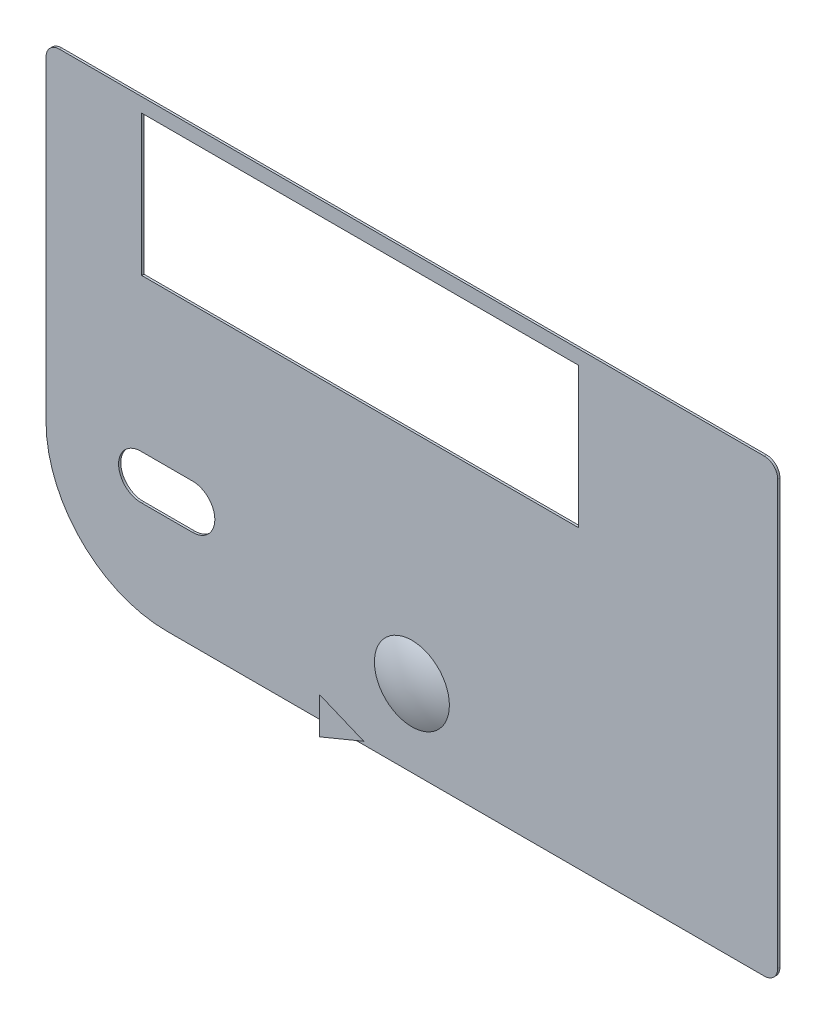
ISO-10303-21;
HEADER;
FILE_DESCRIPTION(('STEP AP214'),'2;1');
FILE_NAME('part.step','',(''),(''),'','','');
FILE_SCHEMA(('AUTOMOTIVE_DESIGN { 1 0 10303 214 1 1 1 1 }'));
ENDSEC;
DATA;
#1=APPLICATION_CONTEXT('core data for automotive mechanical design processes');
#2=APPLICATION_PROTOCOL_DEFINITION('international standard','automotive_design',2000,#1);
#3=PRODUCT_CONTEXT('',#1,'mechanical');
#4=PRODUCT('Part','Part','',(#3));
#5=PRODUCT_RELATED_PRODUCT_CATEGORY('part','',(#4));
#6=PRODUCT_DEFINITION_FORMATION('','',#4);
#7=PRODUCT_DEFINITION_CONTEXT('part definition',#1,'design');
#8=PRODUCT_DEFINITION('design','',#6,#7);
#9=PRODUCT_DEFINITION_SHAPE('','',#8);
#10=(LENGTH_UNIT() NAMED_UNIT(*) SI_UNIT(.MILLI.,.METRE.));
#11=(NAMED_UNIT(*) PLANE_ANGLE_UNIT() SI_UNIT($,.RADIAN.));
#12=(NAMED_UNIT(*) SI_UNIT($,.STERADIAN.) SOLID_ANGLE_UNIT());
#13=UNCERTAINTY_MEASURE_WITH_UNIT(LENGTH_MEASURE(1.E-05),#10,'distance_accuracy_value','');
#14=(GEOMETRIC_REPRESENTATION_CONTEXT(3) GLOBAL_UNCERTAINTY_ASSIGNED_CONTEXT((#13)) GLOBAL_UNIT_ASSIGNED_CONTEXT((#10,
#11,#12)) REPRESENTATION_CONTEXT('',''));
#15=CARTESIAN_POINT('',(0.,0.,0.));
#16=DIRECTION('',(0.,0.,1.));
#17=DIRECTION('',(1.,0.,0.));
#18=AXIS2_PLACEMENT_3D('',#15,#16,#17);
#19=CARTESIAN_POINT('',(-2.5,-22.4852813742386,10.));
#20=DIRECTION('',(0.,0.,-1.));
#21=DIRECTION('',(-1.,0.,0.));
#22=AXIS2_PLACEMENT_3D('',#19,#20,#21);
#23=PLANE('',#22);
#24=DIRECTION('',(0.923879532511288,0.382683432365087,0.));
#25=VECTOR('',#24,1.);
#26=CARTESIAN_POINT('',(-2.5,-22.4852813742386,10.));
#27=LINE('',#26,#25);
#28=CARTESIAN_POINT('',(-2.5,-22.4852813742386,10.));
#29=VERTEX_POINT('',#28);
#30=CARTESIAN_POINT('',(3.5,-20.,10.));
#31=VERTEX_POINT('',#30);
#32=EDGE_CURVE('E55',#29,#31,#27,.T.);
#33=ORIENTED_EDGE('',*,*,#32,.T.);
#34=DIRECTION('',(-0.923879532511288,0.382683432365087,0.));
#35=VECTOR('',#34,1.);
#36=CARTESIAN_POINT('',(3.5,-20.,10.));
#37=LINE('',#36,#35);
#38=CARTESIAN_POINT('',(-2.5,-17.5147186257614,10.));
#39=VERTEX_POINT('',#38);
#40=EDGE_CURVE('E51',#31,#39,#37,.T.);
#41=ORIENTED_EDGE('',*,*,#40,.T.);
#42=DIRECTION('',(0.,-1.,0.));
#43=VECTOR('',#42,1.);
#44=CARTESIAN_POINT('',(-2.5,-17.5147186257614,10.));
#45=LINE('',#44,#43);
#46=EDGE_CURVE('E12',#39,#29,#45,.T.);
#47=ORIENTED_EDGE('',*,*,#46,.T.);
#48=EDGE_LOOP('',(#33,#41,#47));
#49=FACE_BOUND('',#48,.T.);
#50=ADVANCED_FACE('F46',(#49),#23,.F.);
#51=OPEN_SHELL('',(#50));
#52=SHELL_BASED_SURFACE_MODEL('B2',(#51));
#53=CARTESIAN_POINT('',(0.,-20.,-11.2087121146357));
#54=DIRECTION('',(0.,0.,-1.));
#55=DIRECTION('',(0.,1.,0.));
#56=AXIS2_PLACEMENT_3D('',#53,#54,#55);
#57=SPHERICAL_SURFACE('',#56,12.);
#58=CARTESIAN_POINT('',(0.,-20.,-0.299999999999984));
#59=DIRECTION('',(0.,0.,-1.));
#60=DIRECTION('',(0.,1.,0.));
#61=AXIS2_PLACEMENT_3D('',#58,#59,#60);
#62=CIRCLE('',#61,5.);
#63=CARTESIAN_POINT('',(0.,-15.,-0.3));
#64=VERTEX_POINT('',#63);
#65=EDGE_CURVE('E45',#64,#64,#62,.T.);
#66=ORIENTED_EDGE('',*,*,#65,.F.);
#67=EDGE_LOOP('',(#66));
#68=FACE_BOUND('',#67,.T.);
#69=ADVANCED_FACE('F90',(#68),#57,.T.);
#70=CARTESIAN_POINT('',(0.,-15.,-0.300000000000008));
#71=DIRECTION('',(0.,0.,-1.));
#72=DIRECTION('',(0.,1.,0.));
#73=AXIS2_PLACEMENT_3D('',#70,#71,#72);
#74=PLANE('',#73);
#75=ORIENTED_EDGE('',*,*,#65,.T.);
#76=EDGE_LOOP('',(#75));
#77=FACE_BOUND('',#76,.T.);
#78=ADVANCED_FACE('F97',(#77),#74,.T.);
#79=CLOSED_SHELL('',(#69,#78));
#80=MANIFOLD_SOLID_BREP('B6_NOT_SHOWN',#79);
#81=CARTESIAN_POINT('',(-47.625,28.625,-0.3));
#82=DIRECTION('',(0.,0.,1.));
#83=DIRECTION('',(1.,0.,0.));
#84=AXIS2_PLACEMENT_3D('',#81,#82,#83);
#85=PLANE('',#84);
#86=CARTESIAN_POINT('',(-47.625,28.625,-0.3));
#87=DIRECTION('',(0.,0.,1.));
#88=DIRECTION('',(1.,0.,0.));
#89=AXIS2_PLACEMENT_3D('',#86,#87,#88);
#90=CIRCLE('',#89,1.8);
#91=CARTESIAN_POINT('',(-47.625,30.425,-0.3));
#92=VERTEX_POINT('',#91);
#93=CARTESIAN_POINT('',(-49.425,28.625,-0.3));
#94=VERTEX_POINT('',#93);
#95=EDGE_CURVE('E289',#92,#94,#90,.T.);
#96=ORIENTED_EDGE('',*,*,#95,.F.);
#97=DIRECTION('',(-1.,0.,0.));
#98=VECTOR('',#97,1.);
#99=CARTESIAN_POINT('',(-47.625,30.425,-0.3));
#100=LINE('',#99,#98);
#101=CARTESIAN_POINT('',(47.625,30.425,-0.3));
#102=VERTEX_POINT('',#101);
#103=EDGE_CURVE('E311',#102,#92,#100,.T.);
#104=ORIENTED_EDGE('',*,*,#103,.F.);
#105=CARTESIAN_POINT('',(47.625,28.625,-0.3));
#106=DIRECTION('',(0.,0.,1.));
#107=DIRECTION('',(-1.,0.,0.));
#108=AXIS2_PLACEMENT_3D('',#105,#106,#107);
#109=CIRCLE('',#108,1.8);
#110=CARTESIAN_POINT('',(49.425,28.625,-0.3));
#111=VERTEX_POINT('',#110);
#112=EDGE_CURVE('E308',#111,#102,#109,.T.);
#113=ORIENTED_EDGE('',*,*,#112,.F.);
#114=DIRECTION('',(0.,1.,0.));
#115=VECTOR('',#114,1.);
#116=CARTESIAN_POINT('',(49.425,28.625,-0.3));
#117=LINE('',#116,#115);
#118=CARTESIAN_POINT('',(49.425,-28.625,-0.3));
#119=VERTEX_POINT('',#118);
#120=EDGE_CURVE('E305',#119,#111,#117,.T.);
#121=ORIENTED_EDGE('',*,*,#120,.F.);
#122=CARTESIAN_POINT('',(47.625,-28.625,-0.3));
#123=DIRECTION('',(0.,0.,1.));
#124=DIRECTION('',(1.,0.,0.));
#125=AXIS2_PLACEMENT_3D('',#122,#123,#124);
#126=CIRCLE('',#125,1.8);
#127=CARTESIAN_POINT('',(47.625,-30.425,-0.3));
#128=VERTEX_POINT('',#127);
#129=EDGE_CURVE('E302',#128,#119,#126,.T.);
#130=ORIENTED_EDGE('',*,*,#129,.F.);
#131=DIRECTION('',(1.,0.,0.));
#132=VECTOR('',#131,1.);
#133=CARTESIAN_POINT('',(-33.125,-30.425,-0.3));
#134=LINE('',#133,#132);
#135=CARTESIAN_POINT('',(-33.125,-30.425,-0.3));
#136=VERTEX_POINT('',#135);
#137=EDGE_CURVE('E299',#136,#128,#134,.T.);
#138=ORIENTED_EDGE('',*,*,#137,.F.);
#139=CARTESIAN_POINT('',(-33.125,-14.125,-0.3));
#140=DIRECTION('',(0.,0.,1.));
#141=DIRECTION('',(1.,0.,0.));
#142=AXIS2_PLACEMENT_3D('',#139,#140,#141);
#143=CIRCLE('',#142,16.3);
#144=CARTESIAN_POINT('',(-49.425,-14.125,-0.3));
#145=VERTEX_POINT('',#144);
#146=EDGE_CURVE('E296',#145,#136,#143,.T.);
#147=ORIENTED_EDGE('',*,*,#146,.F.);
#148=DIRECTION('',(0.,-1.,0.));
#149=VECTOR('',#148,1.);
#150=CARTESIAN_POINT('',(-49.425,28.625,-0.3));
#151=LINE('',#150,#149);
#152=EDGE_CURVE('E292',#94,#145,#151,.T.);
#153=ORIENTED_EDGE('',*,*,#152,.F.);
#154=EDGE_LOOP('',(#96,#104,#113,#121,#130,#138,#147,#153));
#155=FACE_BOUND('',#154,.T.);
#156=DIRECTION('',(-1.,0.,0.));
#157=VECTOR('',#156,1.);
#158=CARTESIAN_POINT('',(-47.625,-11.1247769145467,-0.3));
#159=LINE('',#158,#157);
#160=CARTESIAN_POINT('',(-29.6250000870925,-11.1247769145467,-0.3));
#161=VERTEX_POINT('',#160);
#162=CARTESIAN_POINT('',(-36.6249999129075,-11.1247769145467,-0.3));
#163=VERTEX_POINT('',#162);
#164=EDGE_CURVE('E282',#161,#163,#159,.T.);
#165=ORIENTED_EDGE('',*,*,#164,.T.);
#166=CARTESIAN_POINT('',(-36.6249999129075,-14.1263385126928,-0.3));
#167=DIRECTION('',(0.,0.,1.));
#168=DIRECTION('',(1.,0.,0.));
#169=AXIS2_PLACEMENT_3D('',#166,#167,#168);
#170=CIRCLE('',#169,3.00156159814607);
#171=CARTESIAN_POINT('',(-36.4881087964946,-17.1247769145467,-0.3));
#172=VERTEX_POINT('',#171);
#173=EDGE_CURVE('E285',#163,#172,#170,.T.);
#174=ORIENTED_EDGE('',*,*,#173,.T.);
#175=DIRECTION('',(1.,0.,0.));
#176=VECTOR('',#175,1.);
#177=CARTESIAN_POINT('',(-47.625,-17.1247769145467,-0.3));
#178=LINE('',#177,#176);
#179=CARTESIAN_POINT('',(-29.6250000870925,-17.1247769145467,-0.3));
#180=VERTEX_POINT('',#179);
#181=EDGE_CURVE('E270',#172,#180,#178,.T.);
#182=ORIENTED_EDGE('',*,*,#181,.T.);
#183=CARTESIAN_POINT('',(-29.6250000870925,-14.1247769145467,-0.3));
#184=DIRECTION('',(0.,0.,1.));
#185=DIRECTION('',(1.,0.,0.));
#186=AXIS2_PLACEMENT_3D('',#183,#184,#185);
#187=CIRCLE('',#186,3.);
#188=EDGE_CURVE('E279',#180,#161,#187,.T.);
#189=ORIENTED_EDGE('',*,*,#188,.T.);
#190=EDGE_LOOP('',(#165,#174,#182,#189));
#191=FACE_BOUND('',#190,.T.);
#192=DIRECTION('',(0.,1.,0.));
#193=VECTOR('',#192,1.);
#194=CARTESIAN_POINT('',(-36.5,28.5,-0.3));
#195=LINE('',#194,#193);
#196=CARTESIAN_POINT('',(-36.5,9.50000000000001,-0.3));
#197=VERTEX_POINT('',#196);
#198=CARTESIAN_POINT('',(-36.5,28.5,-0.3));
#199=VERTEX_POINT('',#198);
#200=EDGE_CURVE('E241',#197,#199,#195,.T.);
#201=ORIENTED_EDGE('',*,*,#200,.F.);
#202=DIRECTION('',(-1.,0.,0.));
#203=VECTOR('',#202,1.);
#204=CARTESIAN_POINT('',(-36.5,9.5,-0.3));
#205=LINE('',#204,#203);
#206=CARTESIAN_POINT('',(22.5,9.5,-0.3));
#207=VERTEX_POINT('',#206);
#208=EDGE_CURVE('E131',#207,#197,#205,.T.);
#209=ORIENTED_EDGE('',*,*,#208,.F.);
#210=DIRECTION('',(0.,-1.,0.));
#211=VECTOR('',#210,1.);
#212=CARTESIAN_POINT('',(22.5,9.5,-0.3));
#213=LINE('',#212,#211);
#214=CARTESIAN_POINT('',(22.5,28.5,-0.3));
#215=VERTEX_POINT('',#214);
#216=EDGE_CURVE('E247',#215,#207,#213,.T.);
#217=ORIENTED_EDGE('',*,*,#216,.F.);
#218=DIRECTION('',(1.,0.,0.));
#219=VECTOR('',#218,1.);
#220=CARTESIAN_POINT('',(22.5,28.5,-0.3));
#221=LINE('',#220,#219);
#222=EDGE_CURVE('E232',#199,#215,#221,.T.);
#223=ORIENTED_EDGE('',*,*,#222,.F.);
#224=EDGE_LOOP('',(#201,#209,#217,#223));
#225=FACE_BOUND('',#224,.T.);
#226=CARTESIAN_POINT('',(0.,-20.,-0.299999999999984));
#227=DIRECTION('',(0.,0.,-1.));
#228=DIRECTION('',(0.,1.,0.));
#229=AXIS2_PLACEMENT_3D('',#226,#227,#228);
#230=CIRCLE('',#229,5.);
#231=CARTESIAN_POINT('',(0.,-15.,-0.3));
#232=VERTEX_POINT('',#231);
#233=EDGE_CURVE('E454',#232,#232,#230,.T.);
#234=ORIENTED_EDGE('',*,*,#233,.F.);
#235=EDGE_LOOP('',(#234));
#236=FACE_BOUND('',#235,.T.);
#237=ADVANCED_FACE('F116',(#155,#191,#225,#236),#85,.F.);
#238=CARTESIAN_POINT('',(-47.625,28.625,-0.3));
#239=DIRECTION('',(0.,0.,1.));
#240=DIRECTION('',(1.,0.,0.));
#241=AXIS2_PLACEMENT_3D('',#238,#239,#240);
#242=CYLINDRICAL_SURFACE('',#241,1.8);
#243=CARTESIAN_POINT('',(-47.625,28.625,0.));
#244=DIRECTION('',(0.,0.,1.));
#245=DIRECTION('',(1.,0.,0.));
#246=AXIS2_PLACEMENT_3D('',#243,#244,#245);
#247=CIRCLE('',#246,1.8);
#248=CARTESIAN_POINT('',(-47.625,30.425,0.));
#249=VERTEX_POINT('',#248);
#250=CARTESIAN_POINT('',(-49.425,28.625,0.));
#251=VERTEX_POINT('',#250);
#252=EDGE_CURVE('E288',#249,#251,#247,.T.);
#253=ORIENTED_EDGE('',*,*,#252,.F.);
#254=DIRECTION('',(0.,0.,1.));
#255=VECTOR('',#254,1.);
#256=CARTESIAN_POINT('',(-47.625,30.425,-0.3));
#257=LINE('',#256,#255);
#258=EDGE_CURVE('E337',#92,#249,#257,.T.);
#259=ORIENTED_EDGE('',*,*,#258,.F.);
#260=ORIENTED_EDGE('',*,*,#95,.T.);
#261=DIRECTION('',(0.,0.,1.));
#262=VECTOR('',#261,1.);
#263=CARTESIAN_POINT('',(-49.425,28.625,-0.3));
#264=LINE('',#263,#262);
#265=EDGE_CURVE('E314',#94,#251,#264,.T.);
#266=ORIENTED_EDGE('',*,*,#265,.T.);
#267=EDGE_LOOP('',(#253,#259,#260,#266));
#268=FACE_BOUND('',#267,.T.);
#269=ADVANCED_FACE('F118',(#268),#242,.T.);
#270=CARTESIAN_POINT('',(-47.625,30.425,-0.3));
#271=DIRECTION('',(0.,1.,0.));
#272=DIRECTION('',(0.,0.,1.));
#273=AXIS2_PLACEMENT_3D('',#270,#271,#272);
#274=PLANE('',#273);
#275=DIRECTION('',(-1.,0.,0.));
#276=VECTOR('',#275,1.);
#277=CARTESIAN_POINT('',(-47.625,30.425,0.));
#278=LINE('',#277,#276);
#279=CARTESIAN_POINT('',(47.625,30.425,0.));
#280=VERTEX_POINT('',#279);
#281=EDGE_CURVE('E293',#280,#249,#278,.T.);
#282=ORIENTED_EDGE('',*,*,#281,.F.);
#283=DIRECTION('',(0.,0.,1.));
#284=VECTOR('',#283,1.);
#285=CARTESIAN_POINT('',(47.625,30.425,-0.3));
#286=LINE('',#285,#284);
#287=EDGE_CURVE('E340',#102,#280,#286,.T.);
#288=ORIENTED_EDGE('',*,*,#287,.F.);
#289=ORIENTED_EDGE('',*,*,#103,.T.);
#290=ORIENTED_EDGE('',*,*,#258,.T.);
#291=EDGE_LOOP('',(#282,#288,#289,#290));
#292=FACE_BOUND('',#291,.T.);
#293=ADVANCED_FACE('F400',(#292),#274,.T.);
#294=CARTESIAN_POINT('',(47.625,28.625,-0.3));
#295=DIRECTION('',(0.,0.,1.));
#296=DIRECTION('',(1.,0.,0.));
#297=AXIS2_PLACEMENT_3D('',#294,#295,#296);
#298=CYLINDRICAL_SURFACE('',#297,1.8);
#299=CARTESIAN_POINT('',(47.625,28.625,0.));
#300=DIRECTION('',(0.,0.,1.));
#301=DIRECTION('',(-1.,0.,0.));
#302=AXIS2_PLACEMENT_3D('',#299,#300,#301);
#303=CIRCLE('',#302,1.8);
#304=CARTESIAN_POINT('',(49.425,28.625,0.));
#305=VERTEX_POINT('',#304);
#306=EDGE_CURVE('E332',#305,#280,#303,.T.);
#307=ORIENTED_EDGE('',*,*,#306,.F.);
#308=DIRECTION('',(0.,0.,1.));
#309=VECTOR('',#308,1.);
#310=CARTESIAN_POINT('',(49.425,28.625,-0.3));
#311=LINE('',#310,#309);
#312=EDGE_CURVE('E342',#111,#305,#311,.T.);
#313=ORIENTED_EDGE('',*,*,#312,.F.);
#314=ORIENTED_EDGE('',*,*,#112,.T.);
#315=ORIENTED_EDGE('',*,*,#287,.T.);
#316=EDGE_LOOP('',(#307,#313,#314,#315));
#317=FACE_BOUND('',#316,.T.);
#318=ADVANCED_FACE('F405',(#317),#298,.T.);
#319=CARTESIAN_POINT('',(49.425,28.625,-0.3));
#320=DIRECTION('',(1.,0.,0.));
#321=DIRECTION('',(0.,0.,-1.));
#322=AXIS2_PLACEMENT_3D('',#319,#320,#321);
#323=PLANE('',#322);
#324=DIRECTION('',(0.,1.,0.));
#325=VECTOR('',#324,1.);
#326=CARTESIAN_POINT('',(49.425,28.625,0.));
#327=LINE('',#326,#325);
#328=CARTESIAN_POINT('',(49.425,-28.625,0.));
#329=VERTEX_POINT('',#328);
#330=EDGE_CURVE('E329',#329,#305,#327,.T.);
#331=ORIENTED_EDGE('',*,*,#330,.F.);
#332=DIRECTION('',(0.,0.,1.));
#333=VECTOR('',#332,1.);
#334=CARTESIAN_POINT('',(49.425,-28.625,-0.3));
#335=LINE('',#334,#333);
#336=EDGE_CURVE('E344',#119,#329,#335,.T.);
#337=ORIENTED_EDGE('',*,*,#336,.F.);
#338=ORIENTED_EDGE('',*,*,#120,.T.);
#339=ORIENTED_EDGE('',*,*,#312,.T.);
#340=EDGE_LOOP('',(#331,#337,#338,#339));
#341=FACE_BOUND('',#340,.T.);
#342=ADVANCED_FACE('F396',(#341),#323,.T.);
#343=CARTESIAN_POINT('',(47.625,-28.625,-0.3));
#344=DIRECTION('',(0.,0.,1.));
#345=DIRECTION('',(1.,0.,0.));
#346=AXIS2_PLACEMENT_3D('',#343,#344,#345);
#347=CYLINDRICAL_SURFACE('',#346,1.8);
#348=CARTESIAN_POINT('',(47.625,-28.625,0.));
#349=DIRECTION('',(0.,0.,1.));
#350=DIRECTION('',(1.,0.,0.));
#351=AXIS2_PLACEMENT_3D('',#348,#349,#350);
#352=CIRCLE('',#351,1.8);
#353=CARTESIAN_POINT('',(47.625,-30.425,0.));
#354=VERTEX_POINT('',#353);
#355=EDGE_CURVE('E326',#354,#329,#352,.T.);
#356=ORIENTED_EDGE('',*,*,#355,.F.);
#357=DIRECTION('',(0.,0.,1.));
#358=VECTOR('',#357,1.);
#359=CARTESIAN_POINT('',(47.625,-30.425,-0.3));
#360=LINE('',#359,#358);
#361=EDGE_CURVE('E346',#128,#354,#360,.T.);
#362=ORIENTED_EDGE('',*,*,#361,.F.);
#363=ORIENTED_EDGE('',*,*,#129,.T.);
#364=ORIENTED_EDGE('',*,*,#336,.T.);
#365=EDGE_LOOP('',(#356,#362,#363,#364));
#366=FACE_BOUND('',#365,.T.);
#367=ADVANCED_FACE('F392',(#366),#347,.T.);
#368=CARTESIAN_POINT('',(-33.125,-30.425,-0.3));
#369=DIRECTION('',(0.,-1.,0.));
#370=DIRECTION('',(0.,0.,-1.));
#371=AXIS2_PLACEMENT_3D('',#368,#369,#370);
#372=PLANE('',#371);
#373=DIRECTION('',(1.,0.,0.));
#374=VECTOR('',#373,1.);
#375=CARTESIAN_POINT('',(-33.125,-30.425,0.));
#376=LINE('',#375,#374);
#377=CARTESIAN_POINT('',(-33.125,-30.425,0.));
#378=VERTEX_POINT('',#377);
#379=EDGE_CURVE('E323',#378,#354,#376,.T.);
#380=ORIENTED_EDGE('',*,*,#379,.F.);
#381=DIRECTION('',(0.,0.,1.));
#382=VECTOR('',#381,1.);
#383=CARTESIAN_POINT('',(-33.125,-30.425,-0.3));
#384=LINE('',#383,#382);
#385=EDGE_CURVE('E348',#136,#378,#384,.T.);
#386=ORIENTED_EDGE('',*,*,#385,.F.);
#387=ORIENTED_EDGE('',*,*,#137,.T.);
#388=ORIENTED_EDGE('',*,*,#361,.T.);
#389=EDGE_LOOP('',(#380,#386,#387,#388));
#390=FACE_BOUND('',#389,.T.);
#391=ADVANCED_FACE('F388',(#390),#372,.T.);
#392=CARTESIAN_POINT('',(-33.125,-14.125,-0.3));
#393=DIRECTION('',(0.,0.,1.));
#394=DIRECTION('',(1.,0.,0.));
#395=AXIS2_PLACEMENT_3D('',#392,#393,#394);
#396=CYLINDRICAL_SURFACE('',#395,16.3);
#397=CARTESIAN_POINT('',(-33.125,-14.125,0.));
#398=DIRECTION('',(0.,0.,1.));
#399=DIRECTION('',(1.,0.,0.));
#400=AXIS2_PLACEMENT_3D('',#397,#398,#399);
#401=CIRCLE('',#400,16.3);
#402=CARTESIAN_POINT('',(-49.425,-14.125,0.));
#403=VERTEX_POINT('',#402);
#404=EDGE_CURVE('E320',#403,#378,#401,.T.);
#405=ORIENTED_EDGE('',*,*,#404,.F.);
#406=DIRECTION('',(0.,0.,1.));
#407=VECTOR('',#406,1.);
#408=CARTESIAN_POINT('',(-49.425,-14.125,-0.3));
#409=LINE('',#408,#407);
#410=EDGE_CURVE('E350',#145,#403,#409,.T.);
#411=ORIENTED_EDGE('',*,*,#410,.F.);
#412=ORIENTED_EDGE('',*,*,#146,.T.);
#413=ORIENTED_EDGE('',*,*,#385,.T.);
#414=EDGE_LOOP('',(#405,#411,#412,#413));
#415=FACE_BOUND('',#414,.T.);
#416=ADVANCED_FACE('F384',(#415),#396,.T.);
#417=CARTESIAN_POINT('',(-49.425,28.625,-0.3));
#418=DIRECTION('',(-1.,0.,0.));
#419=DIRECTION('',(0.,-1.,0.));
#420=AXIS2_PLACEMENT_3D('',#417,#418,#419);
#421=PLANE('',#420);
#422=DIRECTION('',(0.,-1.,0.));
#423=VECTOR('',#422,1.);
#424=CARTESIAN_POINT('',(-49.425,28.625,0.));
#425=LINE('',#424,#423);
#426=EDGE_CURVE('E317',#251,#403,#425,.T.);
#427=ORIENTED_EDGE('',*,*,#426,.F.);
#428=ORIENTED_EDGE('',*,*,#265,.F.);
#429=ORIENTED_EDGE('',*,*,#152,.T.);
#430=ORIENTED_EDGE('',*,*,#410,.T.);
#431=EDGE_LOOP('',(#427,#428,#429,#430));
#432=FACE_BOUND('',#431,.T.);
#433=ADVANCED_FACE('F367',(#432),#421,.T.);
#434=CARTESIAN_POINT('',(-47.625,28.625,0.));
#435=DIRECTION('',(0.,0.,1.));
#436=DIRECTION('',(1.,0.,0.));
#437=AXIS2_PLACEMENT_3D('',#434,#435,#436);
#438=PLANE('',#437);
#439=CARTESIAN_POINT('',(0.,-20.,0.));
#440=DIRECTION('',(0.,0.,1.));
#441=DIRECTION('',(1.,0.,0.));
#442=AXIS2_PLACEMENT_3D('',#439,#440,#441);
#443=CIRCLE('',#442,5.06505406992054);
#444=CARTESIAN_POINT('',(5.06505406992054,-20.,0.));
#445=VERTEX_POINT('',#444);
#446=EDGE_CURVE('E88',#445,#445,#443,.T.);
#447=ORIENTED_EDGE('',*,*,#446,.F.);
#448=EDGE_LOOP('',(#447));
#449=FACE_BOUND('',#448,.T.);
#450=DIRECTION('',(1.,0.,0.));
#451=VECTOR('',#450,1.);
#452=CARTESIAN_POINT('',(-47.625,9.5,0.));
#453=LINE('',#452,#451);
#454=CARTESIAN_POINT('',(-36.5,9.5,0.));
#455=VERTEX_POINT('',#454);
#456=CARTESIAN_POINT('',(22.5,9.5,0.));
#457=VERTEX_POINT('',#456);
#458=EDGE_CURVE('E124',#455,#457,#453,.T.);
#459=ORIENTED_EDGE('',*,*,#458,.F.);
#460=DIRECTION('',(0.,-1.,0.));
#461=VECTOR('',#460,1.);
#462=CARTESIAN_POINT('',(-36.5,28.625,0.));
#463=LINE('',#462,#461);
#464=CARTESIAN_POINT('',(-36.5,28.5,0.));
#465=VERTEX_POINT('',#464);
#466=EDGE_CURVE('E339',#465,#455,#463,.T.);
#467=ORIENTED_EDGE('',*,*,#466,.F.);
#468=DIRECTION('',(-1.,0.,0.));
#469=VECTOR('',#468,1.);
#470=CARTESIAN_POINT('',(-47.625,28.5,0.));
#471=LINE('',#470,#469);
#472=CARTESIAN_POINT('',(22.5,28.5,0.));
#473=VERTEX_POINT('',#472);
#474=EDGE_CURVE('E235',#473,#465,#471,.T.);
#475=ORIENTED_EDGE('',*,*,#474,.F.);
#476=DIRECTION('',(0.,1.,0.));
#477=VECTOR('',#476,1.);
#478=CARTESIAN_POINT('',(22.5,28.625,0.));
#479=LINE('',#478,#477);
#480=EDGE_CURVE('E355',#457,#473,#479,.T.);
#481=ORIENTED_EDGE('',*,*,#480,.F.);
#482=EDGE_LOOP('',(#459,#467,#475,#481));
#483=FACE_BOUND('',#482,.T.);
#484=CARTESIAN_POINT('',(-36.6249999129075,-14.1263385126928,0.));
#485=DIRECTION('',(0.,0.,1.));
#486=DIRECTION('',(1.,0.,0.));
#487=AXIS2_PLACEMENT_3D('',#484,#485,#486);
#488=CIRCLE('',#487,3.00156159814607);
#489=CARTESIAN_POINT('',(-36.6249999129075,-11.1247769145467,0.));
#490=VERTEX_POINT('',#489);
#491=CARTESIAN_POINT('',(-36.4881087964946,-17.1247769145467,0.));
#492=VERTEX_POINT('',#491);
#493=EDGE_CURVE('E254',#490,#492,#488,.T.);
#494=ORIENTED_EDGE('',*,*,#493,.F.);
#495=DIRECTION('',(-1.,0.,0.));
#496=VECTOR('',#495,1.);
#497=CARTESIAN_POINT('',(-36.6249999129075,-11.1247769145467,0.));
#498=LINE('',#497,#496);
#499=CARTESIAN_POINT('',(-29.6250000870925,-11.1247769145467,0.));
#500=VERTEX_POINT('',#499);
#501=EDGE_CURVE('E264',#500,#490,#498,.T.);
#502=ORIENTED_EDGE('',*,*,#501,.F.);
#503=CARTESIAN_POINT('',(-29.6250000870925,-14.1247769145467,0.));
#504=DIRECTION('',(0.,0.,1.));
#505=DIRECTION('',(1.,0.,0.));
#506=AXIS2_PLACEMENT_3D('',#503,#504,#505);
#507=CIRCLE('',#506,3.);
#508=CARTESIAN_POINT('',(-29.6250000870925,-17.1247769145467,0.));
#509=VERTEX_POINT('',#508);
#510=EDGE_CURVE('E261',#509,#500,#507,.T.);
#511=ORIENTED_EDGE('',*,*,#510,.F.);
#512=DIRECTION('',(1.,0.,0.));
#513=VECTOR('',#512,1.);
#514=CARTESIAN_POINT('',(-36.4881087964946,-17.1247769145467,0.));
#515=LINE('',#514,#513);
#516=EDGE_CURVE('E258',#492,#509,#515,.T.);
#517=ORIENTED_EDGE('',*,*,#516,.F.);
#518=EDGE_LOOP('',(#494,#502,#511,#517));
#519=FACE_BOUND('',#518,.T.);
#520=ORIENTED_EDGE('',*,*,#252,.T.);
#521=ORIENTED_EDGE('',*,*,#426,.T.);
#522=ORIENTED_EDGE('',*,*,#404,.T.);
#523=ORIENTED_EDGE('',*,*,#379,.T.);
#524=ORIENTED_EDGE('',*,*,#355,.T.);
#525=ORIENTED_EDGE('',*,*,#330,.T.);
#526=ORIENTED_EDGE('',*,*,#306,.T.);
#527=ORIENTED_EDGE('',*,*,#281,.T.);
#528=EDGE_LOOP('',(#520,#521,#522,#523,#524,#525,#526,#527));
#529=FACE_BOUND('',#528,.T.);
#530=ADVANCED_FACE('F363',(#449,#483,#519,#529),#438,.T.);
#531=CARTESIAN_POINT('',(-36.6249999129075,-14.1263385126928,-10.));
#532=DIRECTION('',(0.,0.,1.));
#533=DIRECTION('',(1.,0.,0.));
#534=AXIS2_PLACEMENT_3D('',#531,#532,#533);
#535=CYLINDRICAL_SURFACE('',#534,3.00156159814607);
#536=DIRECTION('',(0.,0.,1.));
#537=VECTOR('',#536,1.);
#538=CARTESIAN_POINT('',(-36.6249999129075,-11.1247769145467,-10.));
#539=LINE('',#538,#537);
#540=EDGE_CURVE('E268',#163,#490,#539,.T.);
#541=ORIENTED_EDGE('',*,*,#540,.T.);
#542=ORIENTED_EDGE('',*,*,#493,.T.);
#543=DIRECTION('',(0.,0.,1.));
#544=VECTOR('',#543,1.);
#545=CARTESIAN_POINT('',(-36.4881087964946,-17.1247769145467,-10.));
#546=LINE('',#545,#544);
#547=EDGE_CURVE('E267',#172,#492,#546,.T.);
#548=ORIENTED_EDGE('',*,*,#547,.F.);
#549=ORIENTED_EDGE('',*,*,#173,.F.);
#550=EDGE_LOOP('',(#541,#542,#548,#549));
#551=FACE_BOUND('',#550,.T.);
#552=ADVANCED_FACE('F366',(#551),#535,.F.);
#553=CARTESIAN_POINT('',(-36.6249999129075,-11.1247769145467,-10.));
#554=DIRECTION('',(0.,1.,0.));
#555=DIRECTION('',(0.,0.,1.));
#556=AXIS2_PLACEMENT_3D('',#553,#554,#555);
#557=PLANE('',#556);
#558=DIRECTION('',(0.,0.,1.));
#559=VECTOR('',#558,1.);
#560=CARTESIAN_POINT('',(-29.6250000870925,-11.1247769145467,-10.));
#561=LINE('',#560,#559);
#562=EDGE_CURVE('E271',#161,#500,#561,.T.);
#563=ORIENTED_EDGE('',*,*,#562,.T.);
#564=ORIENTED_EDGE('',*,*,#501,.T.);
#565=ORIENTED_EDGE('',*,*,#540,.F.);
#566=ORIENTED_EDGE('',*,*,#164,.F.);
#567=EDGE_LOOP('',(#563,#564,#565,#566));
#568=FACE_BOUND('',#567,.T.);
#569=ADVANCED_FACE('F422',(#568),#557,.F.);
#570=CARTESIAN_POINT('',(-29.6250000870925,-14.1247769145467,-10.));
#571=DIRECTION('',(0.,0.,1.));
#572=DIRECTION('',(1.,0.,0.));
#573=AXIS2_PLACEMENT_3D('',#570,#571,#572);
#574=CYLINDRICAL_SURFACE('',#573,3.);
#575=DIRECTION('',(0.,0.,1.));
#576=VECTOR('',#575,1.);
#577=CARTESIAN_POINT('',(-29.6250000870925,-17.1247769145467,-10.));
#578=LINE('',#577,#576);
#579=EDGE_CURVE('E273',#180,#509,#578,.T.);
#580=ORIENTED_EDGE('',*,*,#579,.T.);
#581=ORIENTED_EDGE('',*,*,#510,.T.);
#582=ORIENTED_EDGE('',*,*,#562,.F.);
#583=ORIENTED_EDGE('',*,*,#188,.F.);
#584=EDGE_LOOP('',(#580,#581,#582,#583));
#585=FACE_BOUND('',#584,.T.);
#586=ADVANCED_FACE('F427',(#585),#574,.F.);
#587=CARTESIAN_POINT('',(-36.4881087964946,-17.1247769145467,-10.));
#588=DIRECTION('',(0.,-1.,0.));
#589=DIRECTION('',(0.,0.,-1.));
#590=AXIS2_PLACEMENT_3D('',#587,#588,#589);
#591=PLANE('',#590);
#592=ORIENTED_EDGE('',*,*,#547,.T.);
#593=ORIENTED_EDGE('',*,*,#516,.T.);
#594=ORIENTED_EDGE('',*,*,#579,.F.);
#595=ORIENTED_EDGE('',*,*,#181,.F.);
#596=EDGE_LOOP('',(#592,#593,#594,#595));
#597=FACE_BOUND('',#596,.T.);
#598=ADVANCED_FACE('F424',(#597),#591,.F.);
#599=CARTESIAN_POINT('',(-36.5,9.5,9.7));
#600=DIRECTION('',(0.,-1.,0.));
#601=DIRECTION('',(1.,0.,0.));
#602=AXIS2_PLACEMENT_3D('',#599,#600,#601);
#603=PLANE('',#602);
#604=ORIENTED_EDGE('',*,*,#458,.T.);
#605=DIRECTION('',(0.,0.,-1.));
#606=VECTOR('',#605,1.);
#607=CARTESIAN_POINT('',(22.5,9.5,9.7));
#608=LINE('',#607,#606);
#609=EDGE_CURVE('E252',#457,#207,#608,.T.);
#610=ORIENTED_EDGE('',*,*,#609,.T.);
#611=ORIENTED_EDGE('',*,*,#208,.T.);
#612=DIRECTION('',(0.,0.,-1.));
#613=VECTOR('',#612,1.);
#614=CARTESIAN_POINT('',(-36.5,9.5,9.7));
#615=LINE('',#614,#613);
#616=EDGE_CURVE('E238',#455,#197,#615,.T.);
#617=ORIENTED_EDGE('',*,*,#616,.F.);
#618=EDGE_LOOP('',(#604,#610,#611,#617));
#619=FACE_BOUND('',#618,.T.);
#620=ADVANCED_FACE('F358',(#619),#603,.F.);
#621=CARTESIAN_POINT('',(22.5,9.5,9.7));
#622=DIRECTION('',(1.,0.,0.));
#623=DIRECTION('',(0.,0.,-1.));
#624=AXIS2_PLACEMENT_3D('',#621,#622,#623);
#625=PLANE('',#624);
#626=ORIENTED_EDGE('',*,*,#480,.T.);
#627=DIRECTION('',(0.,0.,-1.));
#628=VECTOR('',#627,1.);
#629=CARTESIAN_POINT('',(22.5,28.5,9.7));
#630=LINE('',#629,#628);
#631=EDGE_CURVE('E237',#473,#215,#630,.T.);
#632=ORIENTED_EDGE('',*,*,#631,.T.);
#633=ORIENTED_EDGE('',*,*,#216,.T.);
#634=ORIENTED_EDGE('',*,*,#609,.F.);
#635=EDGE_LOOP('',(#626,#632,#633,#634));
#636=FACE_BOUND('',#635,.T.);
#637=ADVANCED_FACE('F362',(#636),#625,.F.);
#638=CARTESIAN_POINT('',(22.5,28.5,9.7));
#639=DIRECTION('',(0.,1.,0.));
#640=DIRECTION('',(-1.,0.,0.));
#641=AXIS2_PLACEMENT_3D('',#638,#639,#640);
#642=PLANE('',#641);
#643=ORIENTED_EDGE('',*,*,#474,.T.);
#644=DIRECTION('',(0.,0.,-1.));
#645=VECTOR('',#644,1.);
#646=CARTESIAN_POINT('',(-36.5,28.5,9.7));
#647=LINE('',#646,#645);
#648=EDGE_CURVE('E139',#465,#199,#647,.T.);
#649=ORIENTED_EDGE('',*,*,#648,.T.);
#650=ORIENTED_EDGE('',*,*,#222,.T.);
#651=ORIENTED_EDGE('',*,*,#631,.F.);
#652=EDGE_LOOP('',(#643,#649,#650,#651));
#653=FACE_BOUND('',#652,.T.);
#654=ADVANCED_FACE('F229',(#653),#642,.F.);
#655=CARTESIAN_POINT('',(-36.5,28.5,9.7));
#656=DIRECTION('',(-1.,0.,0.));
#657=DIRECTION('',(0.,0.,1.));
#658=AXIS2_PLACEMENT_3D('',#655,#656,#657);
#659=PLANE('',#658);
#660=ORIENTED_EDGE('',*,*,#466,.T.);
#661=ORIENTED_EDGE('',*,*,#616,.T.);
#662=ORIENTED_EDGE('',*,*,#200,.T.);
#663=ORIENTED_EDGE('',*,*,#648,.F.);
#664=EDGE_LOOP('',(#660,#661,#662,#663));
#665=FACE_BOUND('',#664,.T.);
#666=ADVANCED_FACE('F242',(#665),#659,.F.);
#667=CARTESIAN_POINT('',(0.,-20.,-11.2087121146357));
#668=DIRECTION('',(0.,0.,-1.));
#669=DIRECTION('',(0.,1.,0.));
#670=AXIS2_PLACEMENT_3D('',#667,#668,#669);
#671=SPHERICAL_SURFACE('',#670,12.3);
#672=ORIENTED_EDGE('',*,*,#446,.T.);
#673=EDGE_LOOP('',(#672));
#674=FACE_BOUND('',#673,.T.);
#675=ADVANCED_FACE('F439',(#674),#671,.T.);
#676=CARTESIAN_POINT('',(0.,-20.,-11.2087121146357));
#677=DIRECTION('',(0.,0.,-1.));
#678=DIRECTION('',(0.,1.,0.));
#679=AXIS2_PLACEMENT_3D('',#676,#677,#678);
#680=SPHERICAL_SURFACE('',#679,12.);
#681=ORIENTED_EDGE('',*,*,#233,.T.);
#682=EDGE_LOOP('',(#681));
#683=FACE_BOUND('',#682,.T.);
#684=ADVANCED_FACE('F446',(#683),#680,.F.);
#685=CLOSED_SHELL('',(#237,#269,#293,#318,#342,#367,#391,#416,#433,#530,#552,#569,#586,#598,
#620,#637,#654,#666,#675,#684));
#686=MANIFOLD_SOLID_BREP('B40',#685);
#687=ADVANCED_BREP_SHAPE_REPRESENTATION('',(#18,#80,#686),#14);
#688=MANIFOLD_SURFACE_SHAPE_REPRESENTATION('',(#18,#52),#14);
#689=SHAPE_REPRESENTATION('',(#18),#14);
#690=SHAPE_DEFINITION_REPRESENTATION(#9,#689);
#691=SHAPE_REPRESENTATION_RELATIONSHIP('','',#689,#687);
#692=SHAPE_REPRESENTATION_RELATIONSHIP('','',#689,#688);
ENDSEC;
END-ISO-10303-21;
